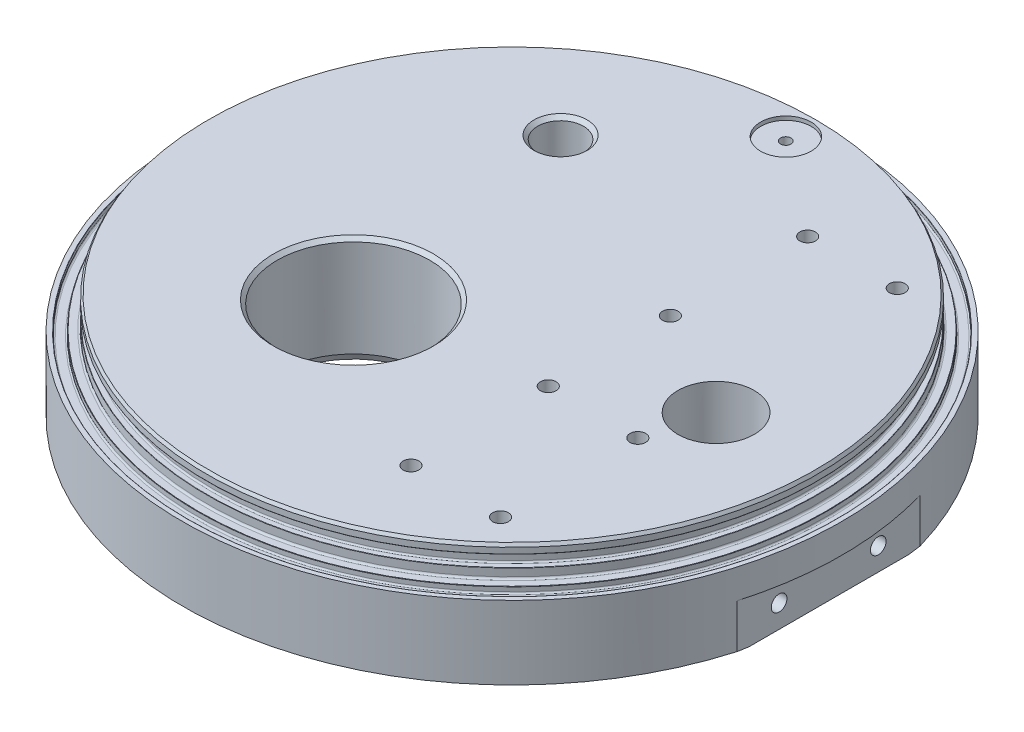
from build123d import *

# Parameters (mm, degrees)
SKETCH5_R                    = 31.75
CUT_EXTRUDE1_DEPTH           = 200.00134095
CIRPATTERN2_COUNT            = 6
CIRPATTERN2_ANGLE            = 240
CHAMFER1_SIZE                = 2.54
CHAMFER1_SIZE2               = 0.825296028
F_3_4_0_75_DIAMETER_HOLE1_D  = 19.05
CHAMFER2_SIZE                = 2.032
CHAMFER2_SIZE2               = 0.544472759
CHAMFER3_SIZE                = 1.524
CHAMFER4_SIZE                = 1.524
CIRPATTERN3_COUNT            = 4
SKETCH15_R                   = 15.875
CUT_EXTRUDE2_DEPTH           = 200.00134095
CHAMFER5_SIZE                = 0.508
CHAMFER5_SIZE2               = 0.184896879
SKETCH16_R                   = 33.274
CUT_EXTRUDE3_DEPTH           = 0.0254
CIRPATTERN4_COUNT            = 4
F_5_16_18_TAPPED_HOLE1_D     = 6.5278
F_5_16_18_TAPPED_HOLE1_DEPTH = 7.2898
F_5_16_18_TAPPED_HOLE1_TIP   = 1.961148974
F_5_16_18_TAPPED_HOLE2_D     = 6.5278
F_5_16_18_TAPPED_HOLE2_DEPTH = 7.2898
F_5_16_18_TAPPED_HOLE2_TIP   = 1.961148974
SKETCH24_R                   = 10.5156
CUT_EXTRUDE4_DEPTH           = 1.5748
F_17_0_173_DIAMETER_HOLE1_D  = 4.3942
SKETCH61_R                   = 10.5156
CUT_EXTRUDE11_DEPTH          = 0.254
SKETCH212_R                  = 57.531
CUT_EXTRUDE12_DEPTH          = 0.127
SKETCH214_W                  = 7.804710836
SKETCH214_H                  = 76.2
CUT_EXTRUDE14_DEPTH          = 19.05
F_5_16_18_TAPPED_HOLE3_D     = 6.5278
F_5_16_18_TAPPED_HOLE3_DEPTH = 20.1168
F_5_16_18_TAPPED_HOLE3_TIP   = 1.961148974
F_5_16_18_TAPPED_HOLE4_D     = 6.5278
F_5_16_18_TAPPED_HOLE4_DEPTH = 20.1168
F_5_16_18_TAPPED_HOLE4_TIP   = 1.961148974
SKETCH219_R                  = 22.225
CUT_EXTRUDE15_DEPTH          = 0.127


with BuildPart() as part:
    # Sketch1 → Revolve1 (revolve)
    with BuildSketch(Plane.XY, mode=Mode.PRIVATE) as revolve1_sk:
        with BuildLine():
            Line((-127, 43.18), (-127, 40.767))
            ThreePointArc((-127, 40.767), (-126.962802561, 40.677197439), (-126.873, 40.64))
            Line((-126.873, 40.64), (-124.9172, 40.64))
            ThreePointArc((-124.9172, 40.64), (-124.468187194, 40.454012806), (-124.2822, 40.005))
            Line((-124.2822, 40.005), (-124.2822, 36.449))
            ThreePointArc((-124.2822, 36.449), (-124.468187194, 35.999987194), (-124.9172, 35.814))
            Line((-124.9172, 35.814), (-126.873, 35.814))
            ThreePointArc((-126.873, 35.814), (-126.962802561, 35.776802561), (-127, 35.687))
            Line((-127, 35.687), (-127, 32.54375))
            ThreePointArc((-127, 32.54375), (-127.232483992, 31.982483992), (-127.79375, 31.75))
            Line((-127.79375, 31.75), (-130.683, 31.75))
            ThreePointArc((-130.683, 31.75), (-130.772802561, 31.712802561), (-130.81, 31.623))
            Line((-130.81, 31.623), (-130.81, 29.8196))
            ThreePointArc((-130.81, 29.8196), (-130.995987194, 29.370587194), (-131.445, 29.1846))
            Line((-131.445, 29.1846), (-134.493, 29.1846))
            ThreePointArc((-134.493, 29.1846), (-134.942012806, 29.370587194), (-135.128, 29.8196))
            Line((-135.128, 29.8196), (-135.128, 31.115))
            ThreePointArc((-135.128, 31.115), (-135.165197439, 31.204802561), (-135.255, 31.242))
            Line((-135.255, 31.242), (-137.16, 31.242))
            Line((-137.16, 31.242), (-137.16, 28.524666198))
            Line((-137.16, 28.524666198), (-137.16, 0.733234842))
            Line((-137.16, 0.733234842), (-135.89, 0))
            Line((-135.89, 0), (0, 0))
            Line((0, 0), (0, 44.45))
            Line((0, 44.45), (-126.266765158, 44.45))
            Line((-126.266765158, 44.45), (-127, 43.18))
        make_face()
    revolve(revolve1_sk.sketch.rotate(Axis((0, 0, 0), (0, 1, 0)), 270), axis=Axis((0, 0, 0), (0, 1, 0)))

    # Sketch4 → M6x1.0 Tapped Hole1 (revolve, cut)
    with BuildSketch(Plane(origin=(-10.145495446, 0, 81.958799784), x_dir=(0, 0, -1), z_dir=(1, 0, 0))):
        Polygon((0, 0), (0, 16.488151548), (2.5, 14.986), (2.5, 0), align=None)
    m6x1_0_tapped_hole1 = revolve(axis=Axis((-10.145495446, -6.35, 81.958799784), (0, 1, 0)), mode=Mode.SUBTRACT)

    # Sketch5 → Cut-Extrude1 (cut, through all)
    with BuildSketch(Plane.XZ):
        with Locations((-31.09182246, 34.912579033)):
            Circle(SKETCH5_R)
    extrude(amount=-CUT_EXTRUDE1_DEPTH, mode=Mode.SUBTRACT)

    # CirPattern2: M6x1.0 Tapped Hole1 ×6 about axis
    cirpattern2_axis = Axis((-31.09182246, 0, 34.912579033), (0, -1, 0))
    for i in range(1, CIRPATTERN2_COUNT):
        add(m6x1_0_tapped_hole1.rotate(cirpattern2_axis, i * CIRPATTERN2_ANGLE / (CIRPATTERN2_COUNT - 1)), mode=Mode.SUBTRACT)

    # Chamfer1
    chamfer1_edges = [part.edges().sort_by_distance(p)[0] for p in [
        (-62.84182246, 0, 34.912579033),
    ]]
    chamfer1_side = [part.faces().sort_by_distance(p)[0] for p in [
        (-62.84182246, 22.225, 34.912579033),
    ]]
    chamfer(chamfer1_edges, length=CHAMFER1_SIZE, length2=CHAMFER1_SIZE2, reference=chamfer1_side[0])

    # 3_4 _0.75_ Diameter Hole1 (through all)
    with Locations(Plane(origin=(0, 0, 0), x_dir=(-1, 0, 0), z_dir=(0, -1, 0))):
        with Locations((47.398610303, 67.578759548)):
            Hole(F_3_4_0_75_DIAMETER_HOLE1_D / 2)

    # Chamfer2
    chamfer2_edges = [part.edges().sort_by_distance(p)[0] for p in [
        (-56.923610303, 0, -67.578759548),
    ]]
    chamfer2_side = [part.faces().sort_by_distance(p)[0] for p in [
        (-56.923610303, 22.225, -67.578759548),
    ]]
    chamfer(chamfer2_edges, length=CHAMFER2_SIZE, length2=CHAMFER2_SIZE2, reference=chamfer2_side[0])

    # Chamfer3
    chamfer3_edges = [part.edges().sort_by_distance(p)[0] for p in [
        (-56.923610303, 44.45, -67.578759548),
    ]]
    chamfer(chamfer3_edges, length=CHAMFER3_SIZE)

    # Chamfer4
    chamfer4_edges = [part.edges().sort_by_distance(p)[0] for p in [
        (-62.84182246, 44.45, 34.912579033),
    ]]
    chamfer(chamfer4_edges, length=CHAMFER4_SIZE)

    # Sketch14 → M4x0.7 Tapped Hole2 (revolve, cut)
    with BuildSketch(Plane(origin=(-35.957764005, 0, -56.13791325), x_dir=(0, 0, -1), z_dir=(1, 0, 0))):
        Polygon((0, 0), (0, 9.957620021), (1.65, 8.9662), (1.65, 0), align=None)
    m4x0_7_tapped_hole2 = revolve(axis=Axis((-35.957764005, -6.35, -56.13791325), (0, 1, 0)), mode=Mode.SUBTRACT)

    # CirPattern3: M4x0.7 Tapped Hole2 ×4 about axis
    cirpattern3_axis = Axis((-47.398610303, 0, -67.578759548), (0, 1, 0))
    for i in range(1, CIRPATTERN3_COUNT):
        add(m4x0_7_tapped_hole2.rotate(cirpattern3_axis, i * 360 / CIRPATTERN3_COUNT), mode=Mode.SUBTRACT)

    # Sketch15 → Cut-Extrude2 (cut, through all)
    with BuildSketch(Plane.XZ):
        with Locations((84.895169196, 0)):
            Circle(SKETCH15_R)
    extrude(amount=-CUT_EXTRUDE2_DEPTH, mode=Mode.SUBTRACT)

    # Chamfer5
    chamfer5_edges = [part.edges().sort_by_distance(p)[0] for p in [
        (69.020169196, 0, 0),
    ]]
    chamfer5_side = [part.faces().sort_by_distance(p)[0] for p in [
        (69.020169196, 22.225, 0),
    ]]
    chamfer(chamfer5_edges, length=CHAMFER5_SIZE, length2=CHAMFER5_SIZE2, reference=chamfer5_side[0])

    # Sketch16 → Cut-Extrude3 (cut)
    with BuildSketch(Plane.XZ):
        with Locations((84.895169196, 0)):
            Circle(SKETCH16_R)
    extrude(amount=-CUT_EXTRUDE3_DEPTH, mode=Mode.SUBTRACT)

    # Sketch19 → 8-32 Tapped Hole1 (revolve, cut)
    with BuildSketch(Plane(origin=(104.630969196, 0.0254, 19.7358), x_dir=(0, 0, -1), z_dir=(1, 0, 0))):
        Polygon((0, 0), (0, 11.756606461), (1.7272, 10.7188), (1.7272, 0), align=None)
    f_8_32_tapped_hole1 = revolve(axis=Axis((104.630969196, -6.3246, 19.7358), (0, 1, 0)), mode=Mode.SUBTRACT)

    # CirPattern4: 8-32 Tapped Hole1 ×4 about axis
    cirpattern4_axis = Axis((84.895169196, 0, 0), (0, 1, 0))
    for i in range(1, CIRPATTERN4_COUNT):
        add(f_8_32_tapped_hole1.rotate(cirpattern4_axis, i * 360 / CIRPATTERN4_COUNT), mode=Mode.SUBTRACT)

    # 5_16-18 Tapped Hole1
    with Locations(Plane(origin=(0, 44.45, 0), x_dir=(1, 0, 0), z_dir=(0, 1, 0))):
        with Locations((77.799371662, 82.493619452), (40.522155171, 82.493619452), (77.799371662, -82.606380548), (40.522155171, -82.606380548), (77.799371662, -25.456380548), (40.522155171, -25.456380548)):
            Hole(F_5_16_18_TAPPED_HOLE1_D / 2, depth=F_5_16_18_TAPPED_HOLE1_DEPTH)
            with Locations((0, 0, -(F_5_16_18_TAPPED_HOLE1_DEPTH + F_5_16_18_TAPPED_HOLE1_TIP / 2))):  # 118° drill point
                Cone(0, F_5_16_18_TAPPED_HOLE1_D / 2, F_5_16_18_TAPPED_HOLE1_TIP, mode=Mode.SUBTRACT)

    # 5_16-18 Tapped Hole2
    with Locations(Plane(origin=(0, 44.45, 0), x_dir=(1, 0, 0), z_dir=(0, 1, 0))):
        with Locations((40.522155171, 25.343619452)):
            Hole(F_5_16_18_TAPPED_HOLE2_D / 2, depth=F_5_16_18_TAPPED_HOLE2_DEPTH)
            with Locations((0, 0, -(F_5_16_18_TAPPED_HOLE2_DEPTH + F_5_16_18_TAPPED_HOLE2_TIP / 2))):  # 118° drill point
                Cone(0, F_5_16_18_TAPPED_HOLE2_D / 2, F_5_16_18_TAPPED_HOLE2_TIP, mode=Mode.SUBTRACT)

    # Sketch24 → Cut-Extrude4 (cut)
    with BuildSketch(Plane(origin=(0, 44.45, 0), x_dir=(1, 0, 0), z_dir=(0, 1, 0))):
        with Locations(Location((0, 113.951433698, 0), (0, 0, 270))):
            Circle(SKETCH24_R)
    extrude(amount=-CUT_EXTRUDE4_DEPTH, mode=Mode.SUBTRACT)

    # 17 _0.173_ Diameter Hole1 (through all)
    with Locations(Plane(origin=(0, 0, 0), x_dir=(-1, 0, 0), z_dir=(0, -1, 0))):
        with Locations((0, 113.903708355)):
            Hole(F_17_0_173_DIAMETER_HOLE1_D / 2)

    # Sketch31 → SAE_4 (revolve, cut)
    with BuildSketch(Plane(origin=(0, 0, -113.903708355), x_dir=(0, 0, -1), z_dir=(1, 0, 0))):
        Polygon((0, 0), (0, 13.8938), (4.96062, 13.8938), (4.96062, 3.08437889), (5.68279889, 2.3622), (6.1849, 0), align=None)
    revolve(axis=Axis((0, -6.445314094, -113.903708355), (0, 1, 0)), mode=Mode.SUBTRACT)

    # Sketch61 → Cut-Extrude11 (cut)
    with BuildSketch(Plane(origin=(12.065707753, 0, -98.036438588), x_dir=(1, 0, 0), z_dir=(0, -1, 0))):
        with Locations(Location((-12.065707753, -15.867269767, 0), (0, 0, 270))):
            Circle(SKETCH61_R)
    extrude(amount=-CUT_EXTRUDE11_DEPTH, mode=Mode.SUBTRACT)

    # Sketch212 → Cut-Extrude12 (cut)
    with BuildSketch(Plane(origin=(0, 0, 0), x_dir=(-1, 0, 0), z_dir=(0, -1, 0))):
        with Locations(Location((31.09182246, -34.912579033, 0), (0, 0, 90))):
            Circle(SKETCH212_R)
    extrude(amount=-CUT_EXTRUDE12_DEPTH, mode=Mode.SUBTRACT)

    # Sketch214 → Cut-Extrude14 (cut)
    with BuildSketch(Plane.XZ):
        with Locations((135.664472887, 0)):
            Rectangle(SKETCH214_W, SKETCH214_H)
        with Locations((-135.664472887, 0)):
            Rectangle(SKETCH214_W, SKETCH214_H)
    extrude(amount=-CUT_EXTRUDE14_DEPTH, mode=Mode.SUBTRACT)

    # 5_16-18 Tapped Hole3
    with Locations(Plane.ZY.offset(131.762117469)):
        with Locations((20.6375, 9.525), (-20.6375, 9.525)):
            Hole(F_5_16_18_TAPPED_HOLE3_D / 2, depth=F_5_16_18_TAPPED_HOLE3_DEPTH)
            with Locations((0, 0, -(F_5_16_18_TAPPED_HOLE3_DEPTH + F_5_16_18_TAPPED_HOLE3_TIP / 2))):  # 118° drill point
                Cone(0, F_5_16_18_TAPPED_HOLE3_D / 2, F_5_16_18_TAPPED_HOLE3_TIP, mode=Mode.SUBTRACT)

    # 5_16-18 Tapped Hole4
    with Locations(Plane(origin=(131.762117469, 0, 0), x_dir=(0, 0, -1), z_dir=(1, 0, 0))):
        with Locations((-20.6375, 9.525), (20.6375, 9.525)):
            Hole(F_5_16_18_TAPPED_HOLE4_D / 2, depth=F_5_16_18_TAPPED_HOLE4_DEPTH)
            with Locations((0, 0, -(F_5_16_18_TAPPED_HOLE4_DEPTH + F_5_16_18_TAPPED_HOLE4_TIP / 2))):  # 118° drill point
                Cone(0, F_5_16_18_TAPPED_HOLE4_D / 2, F_5_16_18_TAPPED_HOLE4_TIP, mode=Mode.SUBTRACT)

    # Sketch219 → Cut-Extrude15 (cut)
    with BuildSketch(Plane.XZ):
        with Locations(Location((-47.398610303, -67.578759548, 0), (0, 0, 270))):
            Circle(SKETCH219_R)
    extrude(amount=-CUT_EXTRUDE15_DEPTH, mode=Mode.SUBTRACT)


solid = part.part
